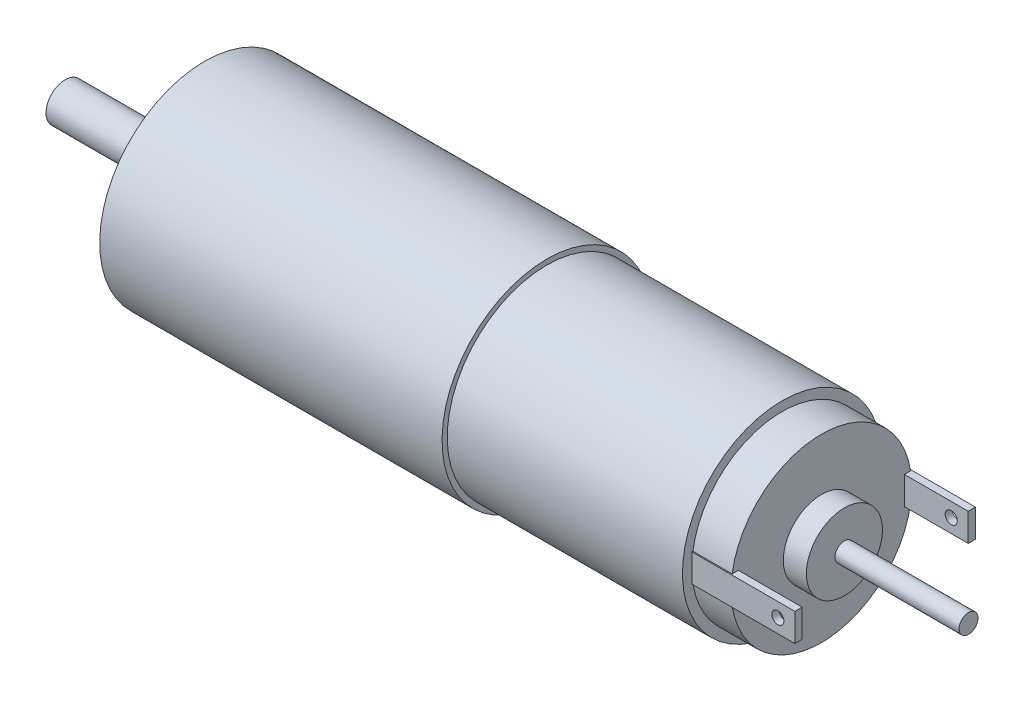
from build123d import *

# Parameters (mm, degrees)
SKETCH2_W                 = 0.762
SKETCH2_H                 = 2.921
EXTRUDE1_DEPTH            = 10.795
CUT_EXTRUDE1_REACH        = 57.551
SKETCH3_R                 = 0.635
F_3_48_TAPPED_HOLE1_D     = 1.9939
F_3_48_TAPPED_HOLE1_DEPTH = 7.6708
F_3_48_TAPPED_HOLE1_TIP   = 0.599027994


with BuildPart() as part:
    # Sketch1 → Revolve1 (revolve)
    with BuildSketch(Plane.XY, mode=Mode.PRIVATE) as revolve1_sk:
        Polygon((0, -10.4394), (24.638, -10.4394), (24.638, -9.4615), (28.7528, -9.4615), (28.7528, -3.9878), (31.1658, -3.9878), (31.1658, -0.9906), (44.1706, -0.9906), (44.1706, 0), (-50.4698, 0), (-50.4698, -2.0066), (-38.9636, -2.0066), (-38.9636, -3.4925), (-37.084, -3.4925), (-37.084, -5.0038), (-35.8648, -5.0038), (-35.8648, -10.9855), (0, -10.9855), align=None)
    revolve(revolve1_sk.sketch.rotate(Axis((44.1706, 0, 0), (-1, 0, 0)), 180), axis=Axis((44.1706, 0, 0), (-1, 0, 0)))

    # Sketch2 → Extrude1 (add)
    with BuildSketch(Plane(origin=(24.638, 0, 0), x_dir=(0, 0, -1), z_dir=(1, 0, 0))):
        with Locations((9.0805, 0)):
            Rectangle(SKETCH2_W, SKETCH2_H)
    extrude1 = extrude(amount=EXTRUDE1_DEPTH)

    # Mirror1: Extrude1 across plane
    add(extrude1.mirror(Plane.XY))

    # Sketch3 → Cut-Extrude1 (cut, up to next)
    with BuildSketch(Plane(origin=(0, 0, -9.4615), x_dir=(-1, 0, 0), z_dir=(0, 0, -1)), mode=Mode.PRIVATE) as cut_extrude1_sk1:
        with Locations((-33.655, 0)):
            Circle(SKETCH3_R)
    cut_extrude1_tool1 = extrude(cut_extrude1_sk1.sketch, amount=-CUT_EXTRUDE1_REACH, mode=Mode.PRIVATE) & part.part
    cut_extrude1 = cut_extrude1_tool1.solids().sort_by_distance((33.655, 0, -9.4615))[0]
    add(cut_extrude1, mode=Mode.SUBTRACT)

    # Mirror2: Cut-Extrude1 across plane
    add(cut_extrude1.mirror(Plane.XY), mode=Mode.SUBTRACT)

    # 3-48 Tapped Hole1
    with Locations(Plane(origin=(-35.8648, 6.995060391, 0), x_dir=(0, -1, 0), z_dir=(-1, 0, 0))):
        with Locations((0, 0), (10.492590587, 6.0579), (10.492590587, -6.0579)):
            Hole(F_3_48_TAPPED_HOLE1_D / 2, depth=F_3_48_TAPPED_HOLE1_DEPTH)
            with Locations((0, 0, -(F_3_48_TAPPED_HOLE1_DEPTH + F_3_48_TAPPED_HOLE1_TIP / 2))):  # 118° drill point
                Cone(0, F_3_48_TAPPED_HOLE1_D / 2, F_3_48_TAPPED_HOLE1_TIP, mode=Mode.SUBTRACT)


solid = part.part
